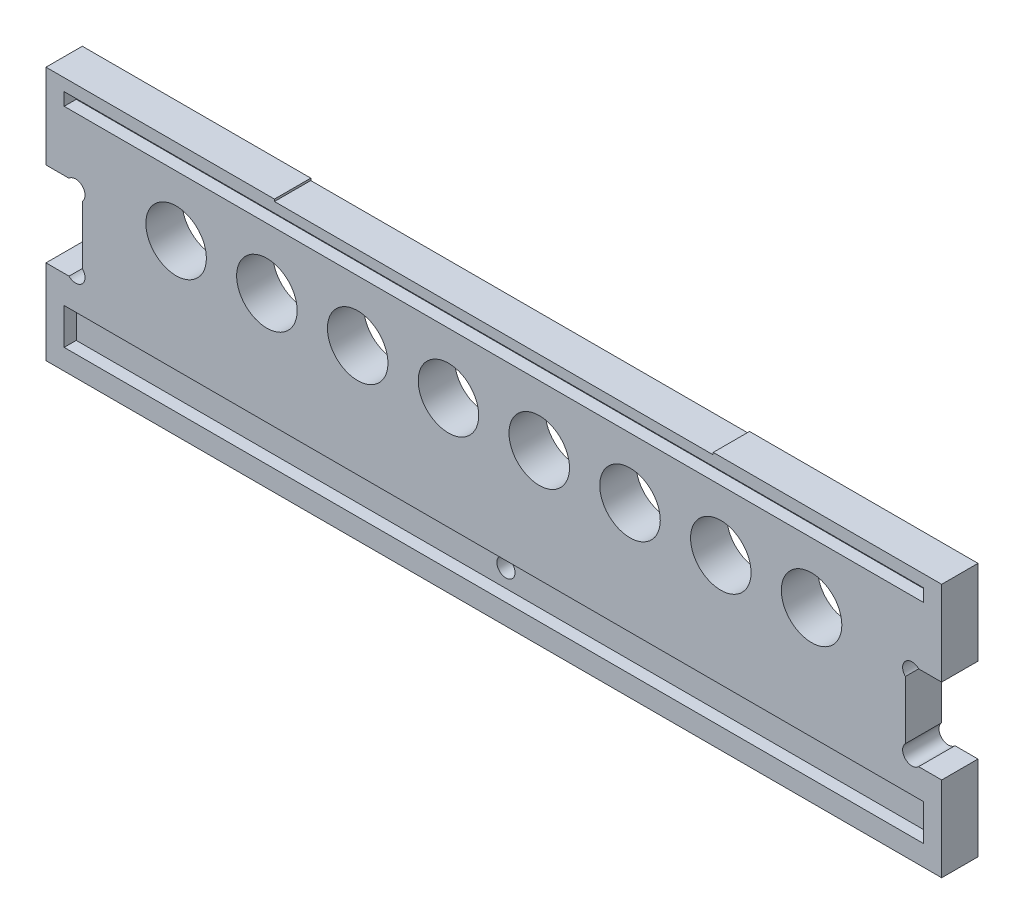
ISO-10303-21;
HEADER;
FILE_DESCRIPTION(('STEP AP214'),'2;1');
FILE_NAME('part.step','',(''),(''),'','','');
FILE_SCHEMA(('AUTOMOTIVE_DESIGN { 1 0 10303 214 1 1 1 1 }'));
ENDSEC;
DATA;
#1=APPLICATION_CONTEXT('core data for automotive mechanical design processes');
#2=APPLICATION_PROTOCOL_DEFINITION('international standard','automotive_design',2000,#1);
#3=PRODUCT_CONTEXT('',#1,'mechanical');
#4=PRODUCT('Part','Part','',(#3));
#5=PRODUCT_RELATED_PRODUCT_CATEGORY('part','',(#4));
#6=PRODUCT_DEFINITION_FORMATION('','',#4);
#7=PRODUCT_DEFINITION_CONTEXT('part definition',#1,'design');
#8=PRODUCT_DEFINITION('design','',#6,#7);
#9=PRODUCT_DEFINITION_SHAPE('','',#8);
#10=(LENGTH_UNIT() NAMED_UNIT(*) SI_UNIT(.MILLI.,.METRE.));
#11=(NAMED_UNIT(*) PLANE_ANGLE_UNIT() SI_UNIT($,.RADIAN.));
#12=(NAMED_UNIT(*) SI_UNIT($,.STERADIAN.) SOLID_ANGLE_UNIT());
#13=UNCERTAINTY_MEASURE_WITH_UNIT(LENGTH_MEASURE(1.E-05),#10,'distance_accuracy_value','');
#14=(GEOMETRIC_REPRESENTATION_CONTEXT(3) GLOBAL_UNCERTAINTY_ASSIGNED_CONTEXT((#13)) GLOBAL_UNIT_ASSIGNED_CONTEXT((#10,
#11,#12)) REPRESENTATION_CONTEXT('',''));
#15=CARTESIAN_POINT('',(0.,0.,0.));
#16=DIRECTION('',(0.,0.,1.));
#17=DIRECTION('',(1.,0.,0.));
#18=AXIS2_PLACEMENT_3D('',#15,#16,#17);
#19=CARTESIAN_POINT('',(74.,6.39762671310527,6.));
#20=DIRECTION('',(0.,0.,-1.));
#21=DIRECTION('',(-1.,0.,0.));
#22=AXIS2_PLACEMENT_3D('',#19,#20,#21);
#23=CYLINDRICAL_SURFACE('',#22,1.5);
#24=CARTESIAN_POINT('',(74.,6.39762671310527,0.));
#25=DIRECTION('',(0.,0.,1.));
#26=DIRECTION('',(1.,0.,0.));
#27=AXIS2_PLACEMENT_3D('',#24,#25,#26);
#28=CIRCLE('',#27,1.5);
#29=CARTESIAN_POINT('',(75.5,6.39762671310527,0.));
#30=VERTEX_POINT('',#29);
#31=EDGE_CURVE('E334',#30,#30,#28,.T.);
#32=ORIENTED_EDGE('',*,*,#31,.F.);
#33=EDGE_LOOP('',(#32));
#34=FACE_BOUND('',#33,.T.);
#35=CARTESIAN_POINT('',(74.,6.39762671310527,4.));
#36=DIRECTION('',(0.,0.,1.));
#37=DIRECTION('',(1.,0.,0.));
#38=AXIS2_PLACEMENT_3D('',#35,#36,#37);
#39=CIRCLE('',#38,1.5);
#40=CARTESIAN_POINT('',(75.5,6.39762671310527,4.));
#41=VERTEX_POINT('',#40);
#42=EDGE_CURVE('E34',#41,#41,#39,.T.);
#43=ORIENTED_EDGE('',*,*,#42,.T.);
#44=EDGE_LOOP('',(#43));
#45=FACE_BOUND('',#44,.T.);
#46=ADVANCED_FACE('F30',(#34,#45),#23,.F.);
#47=CARTESIAN_POINT('',(4.90398448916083,26.9039844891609,6.));
#48=DIRECTION('',(0.,0.,1.));
#49=DIRECTION('',(1.,0.,0.));
#50=AXIS2_PLACEMENT_3D('',#47,#48,#49);
#51=PLANE('',#50);
#52=DIRECTION('',(0.,-1.,0.));
#53=VECTOR('',#52,1.);
#54=CARTESIAN_POINT('',(3.,9.40000000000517,6.));
#55=LINE('',#54,#53);
#56=CARTESIAN_POINT('',(3.,9.40000000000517,6.));
#57=VERTEX_POINT('',#56);
#58=CARTESIAN_POINT('',(3.,3.40000000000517,6.));
#59=VERTEX_POINT('',#58);
#60=EDGE_CURVE('E46',#57,#59,#55,.T.);
#61=ORIENTED_EDGE('',*,*,#60,.F.);
#62=DIRECTION('',(-1.,0.,0.));
#63=VECTOR('',#62,1.);
#64=CARTESIAN_POINT('',(3.,9.40000000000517,6.));
#65=LINE('',#64,#63);
#66=CARTESIAN_POINT('',(145.,9.40000000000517,6.));
#67=VERTEX_POINT('',#66);
#68=EDGE_CURVE('E238',#67,#57,#65,.T.);
#69=ORIENTED_EDGE('',*,*,#68,.F.);
#70=DIRECTION('',(0.,1.,0.));
#71=VECTOR('',#70,1.);
#72=CARTESIAN_POINT('',(145.,9.40000000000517,6.));
#73=LINE('',#72,#71);
#74=CARTESIAN_POINT('',(145.,3.40000000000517,6.));
#75=VERTEX_POINT('',#74);
#76=EDGE_CURVE('E220',#75,#67,#73,.T.);
#77=ORIENTED_EDGE('',*,*,#76,.F.);
#78=DIRECTION('',(1.,0.,0.));
#79=VECTOR('',#78,1.);
#80=CARTESIAN_POINT('',(3.,3.40000000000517,6.));
#81=LINE('',#80,#79);
#82=EDGE_CURVE('E231',#59,#75,#81,.T.);
#83=ORIENTED_EDGE('',*,*,#82,.F.);
#84=EDGE_LOOP('',(#61,#69,#77,#83));
#85=FACE_BOUND('',#84,.T.);
#86=DIRECTION('',(0.,-1.,0.));
#87=VECTOR('',#86,1.);
#88=CARTESIAN_POINT('',(3.,40.,6.));
#89=LINE('',#88,#87);
#90=CARTESIAN_POINT('',(3.,40.,6.));
#91=VERTEX_POINT('',#90);
#92=CARTESIAN_POINT('',(3.,37.89999053,6.));
#93=VERTEX_POINT('',#92);
#94=EDGE_CURVE('E54',#91,#93,#89,.T.);
#95=ORIENTED_EDGE('',*,*,#94,.F.);
#96=DIRECTION('',(-1.,0.,0.));
#97=VECTOR('',#96,1.);
#98=CARTESIAN_POINT('',(3.,40.,6.));
#99=LINE('',#98,#97);
#100=CARTESIAN_POINT('',(145.,40.,6.));
#101=VERTEX_POINT('',#100);
#102=EDGE_CURVE('E263',#101,#91,#99,.T.);
#103=ORIENTED_EDGE('',*,*,#102,.F.);
#104=DIRECTION('',(0.,1.,0.));
#105=VECTOR('',#104,1.);
#106=CARTESIAN_POINT('',(145.,40.,6.));
#107=LINE('',#106,#105);
#108=CARTESIAN_POINT('',(145.,37.89999053,6.));
#109=VERTEX_POINT('',#108);
#110=EDGE_CURVE('E260',#109,#101,#107,.T.);
#111=ORIENTED_EDGE('',*,*,#110,.F.);
#112=DIRECTION('',(1.,0.,0.));
#113=VECTOR('',#112,1.);
#114=CARTESIAN_POINT('',(3.,37.89999053,6.));
#115=LINE('',#114,#113);
#116=EDGE_CURVE('E257',#93,#109,#115,.T.);
#117=ORIENTED_EDGE('',*,*,#116,.F.);
#118=EDGE_LOOP('',(#95,#103,#111,#117));
#119=FACE_BOUND('',#118,.T.);
#120=CARTESIAN_POINT('',(111.5,27.899305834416,6.));
#121=DIRECTION('',(0.,0.,1.));
#122=DIRECTION('',(1.,0.,0.));
#123=AXIS2_PLACEMENT_3D('',#120,#121,#122);
#124=CIRCLE('',#123,5.);
#125=CARTESIAN_POINT('',(116.5,27.899305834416,6.));
#126=VERTEX_POINT('',#125);
#127=EDGE_CURVE('E295',#126,#126,#124,.T.);
#128=ORIENTED_EDGE('',*,*,#127,.F.);
#129=EDGE_LOOP('',(#128));
#130=FACE_BOUND('',#129,.T.);
#131=CARTESIAN_POINT('',(81.5,27.899305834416,6.));
#132=DIRECTION('',(0.,0.,1.));
#133=DIRECTION('',(1.,0.,0.));
#134=AXIS2_PLACEMENT_3D('',#131,#132,#133);
#135=CIRCLE('',#134,5.);
#136=CARTESIAN_POINT('',(86.5,27.899305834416,6.));
#137=VERTEX_POINT('',#136);
#138=EDGE_CURVE('E307',#137,#137,#135,.T.);
#139=ORIENTED_EDGE('',*,*,#138,.F.);
#140=EDGE_LOOP('',(#139));
#141=FACE_BOUND('',#140,.T.);
#142=CARTESIAN_POINT('',(51.5,27.899305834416,6.));
#143=DIRECTION('',(0.,0.,1.));
#144=DIRECTION('',(1.,0.,0.));
#145=AXIS2_PLACEMENT_3D('',#142,#143,#144);
#146=CIRCLE('',#145,5.);
#147=CARTESIAN_POINT('',(56.5,27.899305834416,6.));
#148=VERTEX_POINT('',#147);
#149=EDGE_CURVE('E319',#148,#148,#146,.T.);
#150=ORIENTED_EDGE('',*,*,#149,.F.);
#151=EDGE_LOOP('',(#150));
#152=FACE_BOUND('',#151,.T.);
#153=CARTESIAN_POINT('',(21.5,27.899305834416,6.));
#154=DIRECTION('',(0.,0.,1.));
#155=DIRECTION('',(1.,0.,0.));
#156=AXIS2_PLACEMENT_3D('',#153,#154,#155);
#157=CIRCLE('',#156,5.);
#158=CARTESIAN_POINT('',(26.5,27.899305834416,6.));
#159=VERTEX_POINT('',#158);
#160=EDGE_CURVE('E331',#159,#159,#157,.T.);
#161=ORIENTED_EDGE('',*,*,#160,.F.);
#162=EDGE_LOOP('',(#161));
#163=FACE_BOUND('',#162,.T.);
#164=DIRECTION('',(0.,-1.,0.));
#165=VECTOR('',#164,1.);
#166=CARTESIAN_POINT('',(0.,42.,6.));
#167=LINE('',#166,#165);
#168=CARTESIAN_POINT('',(0.,42.,6.));
#169=VERTEX_POINT('',#168);
#170=CARTESIAN_POINT('',(0.,28.,6.));
#171=VERTEX_POINT('',#170);
#172=EDGE_CURVE('E378',#169,#171,#167,.T.);
#173=ORIENTED_EDGE('',*,*,#172,.T.);
#174=DIRECTION('',(1.,0.,0.));
#175=VECTOR('',#174,1.);
#176=CARTESIAN_POINT('',(0.,28.,6.));
#177=LINE('',#176,#175);
#178=CARTESIAN_POINT('',(3.80796897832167,28.,6.));
#179=VERTEX_POINT('',#178);
#180=EDGE_CURVE('E381',#171,#179,#177,.T.);
#181=ORIENTED_EDGE('',*,*,#180,.T.);
#182=CARTESIAN_POINT('',(4.90398448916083,26.9039844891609,6.));
#183=DIRECTION('',(0.,0.,-1.));
#184=DIRECTION('',(1.,0.,0.));
#185=AXIS2_PLACEMENT_3D('',#182,#183,#184);
#186=CIRCLE('',#185,1.55);
#187=CARTESIAN_POINT('',(6.,25.8079689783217,6.));
#188=VERTEX_POINT('',#187);
#189=EDGE_CURVE('E383',#179,#188,#186,.T.);
#190=ORIENTED_EDGE('',*,*,#189,.T.);
#191=DIRECTION('',(0.,-1.,0.));
#192=VECTOR('',#191,1.);
#193=CARTESIAN_POINT('',(6.,25.8079689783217,6.));
#194=LINE('',#193,#192);
#195=CARTESIAN_POINT('',(6.,16.1920310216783,6.));
#196=VERTEX_POINT('',#195);
#197=EDGE_CURVE('E385',#188,#196,#194,.T.);
#198=ORIENTED_EDGE('',*,*,#197,.T.);
#199=CARTESIAN_POINT('',(4.90398448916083,15.0960155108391,6.));
#200=DIRECTION('',(0.,0.,-1.));
#201=DIRECTION('',(-1.,0.,0.));
#202=AXIS2_PLACEMENT_3D('',#199,#200,#201);
#203=CIRCLE('',#202,1.55);
#204=CARTESIAN_POINT('',(3.80796897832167,14.,6.));
#205=VERTEX_POINT('',#204);
#206=EDGE_CURVE('E387',#196,#205,#203,.T.);
#207=ORIENTED_EDGE('',*,*,#206,.T.);
#208=DIRECTION('',(-1.,0.,0.));
#209=VECTOR('',#208,1.);
#210=CARTESIAN_POINT('',(0.,14.,6.));
#211=LINE('',#210,#209);
#212=CARTESIAN_POINT('',(0.,14.,6.));
#213=VERTEX_POINT('',#212);
#214=EDGE_CURVE('E389',#205,#213,#211,.T.);
#215=ORIENTED_EDGE('',*,*,#214,.T.);
#216=DIRECTION('',(0.,-1.,0.));
#217=VECTOR('',#216,1.);
#218=CARTESIAN_POINT('',(0.,14.,6.));
#219=LINE('',#218,#217);
#220=CARTESIAN_POINT('',(0.,0.,6.));
#221=VERTEX_POINT('',#220);
#222=EDGE_CURVE('E391',#213,#221,#219,.T.);
#223=ORIENTED_EDGE('',*,*,#222,.T.);
#224=DIRECTION('',(1.,0.,0.));
#225=VECTOR('',#224,1.);
#226=CARTESIAN_POINT('',(0.,0.,6.));
#227=LINE('',#226,#225);
#228=CARTESIAN_POINT('',(148.,3.44359306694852E-13,6.));
#229=VERTEX_POINT('',#228);
#230=EDGE_CURVE('E393',#221,#229,#227,.T.);
#231=ORIENTED_EDGE('',*,*,#230,.T.);
#232=DIRECTION('',(0.,1.,0.));
#233=VECTOR('',#232,1.);
#234=CARTESIAN_POINT('',(148.,14.,6.));
#235=LINE('',#234,#233);
#236=CARTESIAN_POINT('',(148.,14.,6.));
#237=VERTEX_POINT('',#236);
#238=EDGE_CURVE('E395',#229,#237,#235,.T.);
#239=ORIENTED_EDGE('',*,*,#238,.T.);
#240=DIRECTION('',(-1.,0.,0.));
#241=VECTOR('',#240,1.);
#242=CARTESIAN_POINT('',(148.,14.,6.));
#243=LINE('',#242,#241);
#244=CARTESIAN_POINT('',(144.192031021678,14.,6.));
#245=VERTEX_POINT('',#244);
#246=EDGE_CURVE('E397',#237,#245,#243,.T.);
#247=ORIENTED_EDGE('',*,*,#246,.T.);
#248=CARTESIAN_POINT('',(143.096015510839,15.0960155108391,6.));
#249=DIRECTION('',(0.,0.,-1.));
#250=DIRECTION('',(1.,0.,0.));
#251=AXIS2_PLACEMENT_3D('',#248,#249,#250);
#252=CIRCLE('',#251,1.55);
#253=CARTESIAN_POINT('',(142.,16.1920310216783,6.));
#254=VERTEX_POINT('',#253);
#255=EDGE_CURVE('E399',#245,#254,#252,.T.);
#256=ORIENTED_EDGE('',*,*,#255,.T.);
#257=DIRECTION('',(0.,1.,0.));
#258=VECTOR('',#257,1.);
#259=CARTESIAN_POINT('',(142.,25.8079689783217,6.));
#260=LINE('',#259,#258);
#261=CARTESIAN_POINT('',(142.,25.8079689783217,6.));
#262=VERTEX_POINT('',#261);
#263=EDGE_CURVE('E401',#254,#262,#260,.T.);
#264=ORIENTED_EDGE('',*,*,#263,.T.);
#265=CARTESIAN_POINT('',(143.096015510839,26.9039844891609,6.));
#266=DIRECTION('',(0.,0.,-1.));
#267=DIRECTION('',(-1.,0.,0.));
#268=AXIS2_PLACEMENT_3D('',#265,#266,#267);
#269=CIRCLE('',#268,1.55);
#270=CARTESIAN_POINT('',(144.192031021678,28.,6.));
#271=VERTEX_POINT('',#270);
#272=EDGE_CURVE('E403',#262,#271,#269,.T.);
#273=ORIENTED_EDGE('',*,*,#272,.T.);
#274=DIRECTION('',(1.,0.,0.));
#275=VECTOR('',#274,1.);
#276=CARTESIAN_POINT('',(148.,28.,6.));
#277=LINE('',#276,#275);
#278=CARTESIAN_POINT('',(148.,28.,6.));
#279=VERTEX_POINT('',#278);
#280=EDGE_CURVE('E405',#271,#279,#277,.T.);
#281=ORIENTED_EDGE('',*,*,#280,.T.);
#282=DIRECTION('',(0.,1.,0.));
#283=VECTOR('',#282,1.);
#284=CARTESIAN_POINT('',(148.,42.0000000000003,6.));
#285=LINE('',#284,#283);
#286=CARTESIAN_POINT('',(148.,42.0000000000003,6.));
#287=VERTEX_POINT('',#286);
#288=EDGE_CURVE('E407',#279,#287,#285,.T.);
#289=ORIENTED_EDGE('',*,*,#288,.T.);
#290=DIRECTION('',(-1.,0.,0.));
#291=VECTOR('',#290,1.);
#292=CARTESIAN_POINT('',(110.25,42.0000000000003,6.));
#293=LINE('',#292,#291);
#294=CARTESIAN_POINT('',(110.25,42.0000000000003,6.));
#295=VERTEX_POINT('',#294);
#296=EDGE_CURVE('E409',#287,#295,#293,.T.);
#297=ORIENTED_EDGE('',*,*,#296,.T.);
#298=DIRECTION('',(0.,-1.,0.));
#299=VECTOR('',#298,1.);
#300=CARTESIAN_POINT('',(110.25,42.0000000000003,6.));
#301=LINE('',#300,#299);
#302=CARTESIAN_POINT('',(110.25,41.65,6.));
#303=VERTEX_POINT('',#302);
#304=EDGE_CURVE('E411',#295,#303,#301,.T.);
#305=ORIENTED_EDGE('',*,*,#304,.T.);
#306=DIRECTION('',(-1.,0.,0.));
#307=VECTOR('',#306,1.);
#308=CARTESIAN_POINT('',(37.75,41.65,6.));
#309=LINE('',#308,#307);
#310=CARTESIAN_POINT('',(37.75,41.65,6.));
#311=VERTEX_POINT('',#310);
#312=EDGE_CURVE('E413',#303,#311,#309,.T.);
#313=ORIENTED_EDGE('',*,*,#312,.T.);
#314=DIRECTION('',(0.,1.,0.));
#315=VECTOR('',#314,1.);
#316=CARTESIAN_POINT('',(37.75,41.65,6.));
#317=LINE('',#316,#315);
#318=CARTESIAN_POINT('',(37.75,42.0000000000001,6.));
#319=VERTEX_POINT('',#318);
#320=EDGE_CURVE('E415',#311,#319,#317,.T.);
#321=ORIENTED_EDGE('',*,*,#320,.T.);
#322=DIRECTION('',(-1.,0.,0.));
#323=VECTOR('',#322,1.);
#324=CARTESIAN_POINT('',(0.,42.,6.));
#325=LINE('',#324,#323);
#326=EDGE_CURVE('E417',#319,#169,#325,.T.);
#327=ORIENTED_EDGE('',*,*,#326,.T.);
#328=EDGE_LOOP('',(#173,#181,#190,#198,#207,#215,#223,#231,#239,#247,#256,#264,#273,#281,#289,
#297,#305,#313,#321,#327));
#329=FACE_BOUND('',#328,.T.);
#330=CARTESIAN_POINT('',(36.5,27.899305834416,6.));
#331=DIRECTION('',(0.,0.,1.));
#332=DIRECTION('',(1.,0.,0.));
#333=AXIS2_PLACEMENT_3D('',#330,#331,#332);
#334=CIRCLE('',#333,5.);
#335=CARTESIAN_POINT('',(41.5,27.899305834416,6.));
#336=VERTEX_POINT('',#335);
#337=EDGE_CURVE('E325',#336,#336,#334,.T.);
#338=ORIENTED_EDGE('',*,*,#337,.F.);
#339=EDGE_LOOP('',(#338));
#340=FACE_BOUND('',#339,.T.);
#341=CARTESIAN_POINT('',(66.5,27.899305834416,6.));
#342=DIRECTION('',(0.,0.,1.));
#343=DIRECTION('',(1.,0.,0.));
#344=AXIS2_PLACEMENT_3D('',#341,#342,#343);
#345=CIRCLE('',#344,5.);
#346=CARTESIAN_POINT('',(71.5,27.899305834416,6.));
#347=VERTEX_POINT('',#346);
#348=EDGE_CURVE('E313',#347,#347,#345,.T.);
#349=ORIENTED_EDGE('',*,*,#348,.F.);
#350=EDGE_LOOP('',(#349));
#351=FACE_BOUND('',#350,.T.);
#352=CARTESIAN_POINT('',(96.5,27.899305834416,6.));
#353=DIRECTION('',(0.,0.,1.));
#354=DIRECTION('',(1.,0.,0.));
#355=AXIS2_PLACEMENT_3D('',#352,#353,#354);
#356=CIRCLE('',#355,5.);
#357=CARTESIAN_POINT('',(101.5,27.899305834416,6.));
#358=VERTEX_POINT('',#357);
#359=EDGE_CURVE('E301',#358,#358,#356,.T.);
#360=ORIENTED_EDGE('',*,*,#359,.F.);
#361=EDGE_LOOP('',(#360));
#362=FACE_BOUND('',#361,.T.);
#363=CARTESIAN_POINT('',(126.5,27.899305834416,6.));
#364=DIRECTION('',(0.,0.,1.));
#365=DIRECTION('',(1.,0.,0.));
#366=AXIS2_PLACEMENT_3D('',#363,#364,#365);
#367=CIRCLE('',#366,4.99999999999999);
#368=CARTESIAN_POINT('',(131.5,27.899305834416,6.));
#369=VERTEX_POINT('',#368);
#370=EDGE_CURVE('E289',#369,#369,#367,.T.);
#371=ORIENTED_EDGE('',*,*,#370,.F.);
#372=EDGE_LOOP('',(#371));
#373=FACE_BOUND('',#372,.T.);
#374=ADVANCED_FACE('F235',(#85,#119,#130,#141,#152,#163,#329,#340,#351,#362,#373),#51,.T.);
#375=CARTESIAN_POINT('',(4.90398448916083,26.9039844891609,0.));
#376=DIRECTION('',(0.,0.,1.));
#377=DIRECTION('',(1.,0.,0.));
#378=AXIS2_PLACEMENT_3D('',#375,#376,#377);
#379=PLANE('',#378);
#380=CARTESIAN_POINT('',(111.5,27.899305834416,0.));
#381=DIRECTION('',(0.,0.,1.));
#382=DIRECTION('',(1.,0.,0.));
#383=AXIS2_PLACEMENT_3D('',#380,#381,#382);
#384=CIRCLE('',#383,5.);
#385=CARTESIAN_POINT('',(116.5,27.899305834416,0.));
#386=VERTEX_POINT('',#385);
#387=EDGE_CURVE('E292',#386,#386,#384,.T.);
#388=ORIENTED_EDGE('',*,*,#387,.T.);
#389=EDGE_LOOP('',(#388));
#390=FACE_BOUND('',#389,.T.);
#391=CARTESIAN_POINT('',(81.5,27.899305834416,0.));
#392=DIRECTION('',(0.,0.,1.));
#393=DIRECTION('',(1.,0.,0.));
#394=AXIS2_PLACEMENT_3D('',#391,#392,#393);
#395=CIRCLE('',#394,5.);
#396=CARTESIAN_POINT('',(86.5,27.899305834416,0.));
#397=VERTEX_POINT('',#396);
#398=EDGE_CURVE('E304',#397,#397,#395,.T.);
#399=ORIENTED_EDGE('',*,*,#398,.T.);
#400=EDGE_LOOP('',(#399));
#401=FACE_BOUND('',#400,.T.);
#402=CARTESIAN_POINT('',(51.5,27.899305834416,0.));
#403=DIRECTION('',(0.,0.,1.));
#404=DIRECTION('',(1.,0.,0.));
#405=AXIS2_PLACEMENT_3D('',#402,#403,#404);
#406=CIRCLE('',#405,5.);
#407=CARTESIAN_POINT('',(56.5,27.899305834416,0.));
#408=VERTEX_POINT('',#407);
#409=EDGE_CURVE('E316',#408,#408,#406,.T.);
#410=ORIENTED_EDGE('',*,*,#409,.T.);
#411=EDGE_LOOP('',(#410));
#412=FACE_BOUND('',#411,.T.);
#413=CARTESIAN_POINT('',(21.5,27.899305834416,0.));
#414=DIRECTION('',(0.,0.,1.));
#415=DIRECTION('',(1.,0.,0.));
#416=AXIS2_PLACEMENT_3D('',#413,#414,#415);
#417=CIRCLE('',#416,5.);
#418=CARTESIAN_POINT('',(26.5,27.899305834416,0.));
#419=VERTEX_POINT('',#418);
#420=EDGE_CURVE('E328',#419,#419,#417,.T.);
#421=ORIENTED_EDGE('',*,*,#420,.T.);
#422=EDGE_LOOP('',(#421));
#423=FACE_BOUND('',#422,.T.);
#424=DIRECTION('',(0.,-1.,0.));
#425=VECTOR('',#424,1.);
#426=CARTESIAN_POINT('',(0.,42.,0.));
#427=LINE('',#426,#425);
#428=CARTESIAN_POINT('',(0.,42.,0.));
#429=VERTEX_POINT('',#428);
#430=CARTESIAN_POINT('',(0.,28.,0.));
#431=VERTEX_POINT('',#430);
#432=EDGE_CURVE('E337',#429,#431,#427,.T.);
#433=ORIENTED_EDGE('',*,*,#432,.F.);
#434=DIRECTION('',(-1.,0.,0.));
#435=VECTOR('',#434,1.);
#436=CARTESIAN_POINT('',(0.,42.,0.));
#437=LINE('',#436,#435);
#438=CARTESIAN_POINT('',(37.75,42.0000000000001,0.));
#439=VERTEX_POINT('',#438);
#440=EDGE_CURVE('E376',#439,#429,#437,.T.);
#441=ORIENTED_EDGE('',*,*,#440,.F.);
#442=DIRECTION('',(0.,1.,0.));
#443=VECTOR('',#442,1.);
#444=CARTESIAN_POINT('',(37.75,41.65,0.));
#445=LINE('',#444,#443);
#446=CARTESIAN_POINT('',(37.75,41.65,0.));
#447=VERTEX_POINT('',#446);
#448=EDGE_CURVE('E374',#447,#439,#445,.T.);
#449=ORIENTED_EDGE('',*,*,#448,.F.);
#450=DIRECTION('',(-1.,0.,0.));
#451=VECTOR('',#450,1.);
#452=CARTESIAN_POINT('',(37.75,41.65,0.));
#453=LINE('',#452,#451);
#454=CARTESIAN_POINT('',(110.25,41.65,0.));
#455=VERTEX_POINT('',#454);
#456=EDGE_CURVE('E372',#455,#447,#453,.T.);
#457=ORIENTED_EDGE('',*,*,#456,.F.);
#458=DIRECTION('',(0.,-1.,0.));
#459=VECTOR('',#458,1.);
#460=CARTESIAN_POINT('',(110.25,42.0000000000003,0.));
#461=LINE('',#460,#459);
#462=CARTESIAN_POINT('',(110.25,42.0000000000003,0.));
#463=VERTEX_POINT('',#462);
#464=EDGE_CURVE('E370',#463,#455,#461,.T.);
#465=ORIENTED_EDGE('',*,*,#464,.F.);
#466=DIRECTION('',(-1.,0.,0.));
#467=VECTOR('',#466,1.);
#468=CARTESIAN_POINT('',(110.25,42.0000000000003,0.));
#469=LINE('',#468,#467);
#470=CARTESIAN_POINT('',(148.,42.0000000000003,0.));
#471=VERTEX_POINT('',#470);
#472=EDGE_CURVE('E368',#471,#463,#469,.T.);
#473=ORIENTED_EDGE('',*,*,#472,.F.);
#474=DIRECTION('',(0.,1.,0.));
#475=VECTOR('',#474,1.);
#476=CARTESIAN_POINT('',(148.,42.0000000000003,0.));
#477=LINE('',#476,#475);
#478=CARTESIAN_POINT('',(148.,28.,0.));
#479=VERTEX_POINT('',#478);
#480=EDGE_CURVE('E366',#479,#471,#477,.T.);
#481=ORIENTED_EDGE('',*,*,#480,.F.);
#482=DIRECTION('',(1.,0.,0.));
#483=VECTOR('',#482,1.);
#484=CARTESIAN_POINT('',(148.,28.,0.));
#485=LINE('',#484,#483);
#486=CARTESIAN_POINT('',(144.192031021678,28.,0.));
#487=VERTEX_POINT('',#486);
#488=EDGE_CURVE('E364',#487,#479,#485,.T.);
#489=ORIENTED_EDGE('',*,*,#488,.F.);
#490=CARTESIAN_POINT('',(143.096015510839,26.9039844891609,0.));
#491=DIRECTION('',(0.,0.,-1.));
#492=DIRECTION('',(-1.,0.,0.));
#493=AXIS2_PLACEMENT_3D('',#490,#491,#492);
#494=CIRCLE('',#493,1.55);
#495=CARTESIAN_POINT('',(142.,25.8079689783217,0.));
#496=VERTEX_POINT('',#495);
#497=EDGE_CURVE('E362',#496,#487,#494,.T.);
#498=ORIENTED_EDGE('',*,*,#497,.F.);
#499=DIRECTION('',(0.,1.,0.));
#500=VECTOR('',#499,1.);
#501=CARTESIAN_POINT('',(142.,25.8079689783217,0.));
#502=LINE('',#501,#500);
#503=CARTESIAN_POINT('',(142.,16.1920310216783,0.));
#504=VERTEX_POINT('',#503);
#505=EDGE_CURVE('E360',#504,#496,#502,.T.);
#506=ORIENTED_EDGE('',*,*,#505,.F.);
#507=CARTESIAN_POINT('',(143.096015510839,15.0960155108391,0.));
#508=DIRECTION('',(0.,0.,-1.));
#509=DIRECTION('',(1.,0.,0.));
#510=AXIS2_PLACEMENT_3D('',#507,#508,#509);
#511=CIRCLE('',#510,1.55);
#512=CARTESIAN_POINT('',(144.192031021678,14.,0.));
#513=VERTEX_POINT('',#512);
#514=EDGE_CURVE('E358',#513,#504,#511,.T.);
#515=ORIENTED_EDGE('',*,*,#514,.F.);
#516=DIRECTION('',(-1.,0.,0.));
#517=VECTOR('',#516,1.);
#518=CARTESIAN_POINT('',(148.,14.,0.));
#519=LINE('',#518,#517);
#520=CARTESIAN_POINT('',(148.,14.,0.));
#521=VERTEX_POINT('',#520);
#522=EDGE_CURVE('E356',#521,#513,#519,.T.);
#523=ORIENTED_EDGE('',*,*,#522,.F.);
#524=DIRECTION('',(0.,1.,0.));
#525=VECTOR('',#524,1.);
#526=CARTESIAN_POINT('',(148.,14.,0.));
#527=LINE('',#526,#525);
#528=CARTESIAN_POINT('',(148.,3.44359306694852E-13,0.));
#529=VERTEX_POINT('',#528);
#530=EDGE_CURVE('E354',#529,#521,#527,.T.);
#531=ORIENTED_EDGE('',*,*,#530,.F.);
#532=DIRECTION('',(1.,0.,0.));
#533=VECTOR('',#532,1.);
#534=CARTESIAN_POINT('',(0.,0.,0.));
#535=LINE('',#534,#533);
#536=CARTESIAN_POINT('',(0.,0.,0.));
#537=VERTEX_POINT('',#536);
#538=EDGE_CURVE('E352',#537,#529,#535,.T.);
#539=ORIENTED_EDGE('',*,*,#538,.F.);
#540=DIRECTION('',(0.,-1.,0.));
#541=VECTOR('',#540,1.);
#542=CARTESIAN_POINT('',(0.,14.,0.));
#543=LINE('',#542,#541);
#544=CARTESIAN_POINT('',(0.,14.,0.));
#545=VERTEX_POINT('',#544);
#546=EDGE_CURVE('E350',#545,#537,#543,.T.);
#547=ORIENTED_EDGE('',*,*,#546,.F.);
#548=DIRECTION('',(-1.,0.,0.));
#549=VECTOR('',#548,1.);
#550=CARTESIAN_POINT('',(0.,14.,0.));
#551=LINE('',#550,#549);
#552=CARTESIAN_POINT('',(3.80796897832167,14.,0.));
#553=VERTEX_POINT('',#552);
#554=EDGE_CURVE('E348',#553,#545,#551,.T.);
#555=ORIENTED_EDGE('',*,*,#554,.F.);
#556=CARTESIAN_POINT('',(4.90398448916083,15.0960155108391,0.));
#557=DIRECTION('',(0.,0.,-1.));
#558=DIRECTION('',(-1.,0.,0.));
#559=AXIS2_PLACEMENT_3D('',#556,#557,#558);
#560=CIRCLE('',#559,1.55);
#561=CARTESIAN_POINT('',(6.,16.1920310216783,0.));
#562=VERTEX_POINT('',#561);
#563=EDGE_CURVE('E346',#562,#553,#560,.T.);
#564=ORIENTED_EDGE('',*,*,#563,.F.);
#565=DIRECTION('',(0.,-1.,0.));
#566=VECTOR('',#565,1.);
#567=CARTESIAN_POINT('',(6.,25.8079689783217,0.));
#568=LINE('',#567,#566);
#569=CARTESIAN_POINT('',(6.,25.8079689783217,0.));
#570=VERTEX_POINT('',#569);
#571=EDGE_CURVE('E344',#570,#562,#568,.T.);
#572=ORIENTED_EDGE('',*,*,#571,.F.);
#573=CARTESIAN_POINT('',(4.90398448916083,26.9039844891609,0.));
#574=DIRECTION('',(0.,0.,-1.));
#575=DIRECTION('',(1.,0.,0.));
#576=AXIS2_PLACEMENT_3D('',#573,#574,#575);
#577=CIRCLE('',#576,1.55);
#578=CARTESIAN_POINT('',(3.80796897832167,28.,0.));
#579=VERTEX_POINT('',#578);
#580=EDGE_CURVE('E342',#579,#570,#577,.T.);
#581=ORIENTED_EDGE('',*,*,#580,.F.);
#582=DIRECTION('',(1.,0.,0.));
#583=VECTOR('',#582,1.);
#584=CARTESIAN_POINT('',(0.,28.,0.));
#585=LINE('',#584,#583);
#586=EDGE_CURVE('E340',#431,#579,#585,.T.);
#587=ORIENTED_EDGE('',*,*,#586,.F.);
#588=EDGE_LOOP('',(#433,#441,#449,#457,#465,#473,#481,#489,#498,#506,#515,#523,#531,#539,#547,
#555,#564,#572,#581,#587));
#589=FACE_BOUND('',#588,.T.);
#590=ORIENTED_EDGE('',*,*,#31,.T.);
#591=EDGE_LOOP('',(#590));
#592=FACE_BOUND('',#591,.T.);
#593=CARTESIAN_POINT('',(36.5,27.899305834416,0.));
#594=DIRECTION('',(0.,0.,1.));
#595=DIRECTION('',(1.,0.,0.));
#596=AXIS2_PLACEMENT_3D('',#593,#594,#595);
#597=CIRCLE('',#596,5.);
#598=CARTESIAN_POINT('',(41.5,27.899305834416,0.));
#599=VERTEX_POINT('',#598);
#600=EDGE_CURVE('E322',#599,#599,#597,.T.);
#601=ORIENTED_EDGE('',*,*,#600,.T.);
#602=EDGE_LOOP('',(#601));
#603=FACE_BOUND('',#602,.T.);
#604=CARTESIAN_POINT('',(66.5,27.899305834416,0.));
#605=DIRECTION('',(0.,0.,1.));
#606=DIRECTION('',(1.,0.,0.));
#607=AXIS2_PLACEMENT_3D('',#604,#605,#606);
#608=CIRCLE('',#607,5.);
#609=CARTESIAN_POINT('',(71.5,27.899305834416,0.));
#610=VERTEX_POINT('',#609);
#611=EDGE_CURVE('E310',#610,#610,#608,.T.);
#612=ORIENTED_EDGE('',*,*,#611,.T.);
#613=EDGE_LOOP('',(#612));
#614=FACE_BOUND('',#613,.T.);
#615=CARTESIAN_POINT('',(96.5,27.899305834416,0.));
#616=DIRECTION('',(0.,0.,1.));
#617=DIRECTION('',(1.,0.,0.));
#618=AXIS2_PLACEMENT_3D('',#615,#616,#617);
#619=CIRCLE('',#618,5.);
#620=CARTESIAN_POINT('',(101.5,27.899305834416,0.));
#621=VERTEX_POINT('',#620);
#622=EDGE_CURVE('E298',#621,#621,#619,.T.);
#623=ORIENTED_EDGE('',*,*,#622,.T.);
#624=EDGE_LOOP('',(#623));
#625=FACE_BOUND('',#624,.T.);
#626=CARTESIAN_POINT('',(126.5,27.899305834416,0.));
#627=DIRECTION('',(0.,0.,1.));
#628=DIRECTION('',(1.,0.,0.));
#629=AXIS2_PLACEMENT_3D('',#626,#627,#628);
#630=CIRCLE('',#629,4.99999999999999);
#631=CARTESIAN_POINT('',(131.5,27.899305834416,0.));
#632=VERTEX_POINT('',#631);
#633=EDGE_CURVE('E281',#632,#632,#630,.T.);
#634=ORIENTED_EDGE('',*,*,#633,.T.);
#635=EDGE_LOOP('',(#634));
#636=FACE_BOUND('',#635,.T.);
#637=ADVANCED_FACE('F484',(#390,#401,#412,#423,#589,#592,#603,#614,#625,#636),#379,.F.);
#638=CARTESIAN_POINT('',(0.,42.,6.));
#639=DIRECTION('',(1.,0.,0.));
#640=DIRECTION('',(0.,1.,0.));
#641=AXIS2_PLACEMENT_3D('',#638,#639,#640);
#642=PLANE('',#641);
#643=ORIENTED_EDGE('',*,*,#432,.T.);
#644=DIRECTION('',(0.,0.,-1.));
#645=VECTOR('',#644,1.);
#646=CARTESIAN_POINT('',(0.,28.,6.));
#647=LINE('',#646,#645);
#648=EDGE_CURVE('E11',#171,#431,#647,.T.);
#649=ORIENTED_EDGE('',*,*,#648,.F.);
#650=ORIENTED_EDGE('',*,*,#172,.F.);
#651=DIRECTION('',(0.,0.,-1.));
#652=VECTOR('',#651,1.);
#653=CARTESIAN_POINT('',(0.,42.,6.));
#654=LINE('',#653,#652);
#655=EDGE_CURVE('E419',#169,#429,#654,.T.);
#656=ORIENTED_EDGE('',*,*,#655,.T.);
#657=EDGE_LOOP('',(#643,#649,#650,#656));
#658=FACE_BOUND('',#657,.T.);
#659=ADVANCED_FACE('F32',(#658),#642,.F.);
#660=CARTESIAN_POINT('',(0.,28.,6.));
#661=DIRECTION('',(0.,1.,0.));
#662=DIRECTION('',(0.,0.,1.));
#663=AXIS2_PLACEMENT_3D('',#660,#661,#662);
#664=PLANE('',#663);
#665=ORIENTED_EDGE('',*,*,#586,.T.);
#666=DIRECTION('',(0.,0.,-1.));
#667=VECTOR('',#666,1.);
#668=CARTESIAN_POINT('',(3.80796897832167,28.,6.));
#669=LINE('',#668,#667);
#670=EDGE_CURVE('E39',#179,#579,#669,.T.);
#671=ORIENTED_EDGE('',*,*,#670,.F.);
#672=ORIENTED_EDGE('',*,*,#180,.F.);
#673=ORIENTED_EDGE('',*,*,#648,.T.);
#674=EDGE_LOOP('',(#665,#671,#672,#673));
#675=FACE_BOUND('',#674,.T.);
#676=ADVANCED_FACE('F502',(#675),#664,.F.);
#677=CARTESIAN_POINT('',(4.90398448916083,26.9039844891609,6.));
#678=DIRECTION('',(0.,0.,-1.));
#679=DIRECTION('',(-1.,0.,0.));
#680=AXIS2_PLACEMENT_3D('',#677,#678,#679);
#681=CYLINDRICAL_SURFACE('',#680,1.55);
#682=ORIENTED_EDGE('',*,*,#580,.T.);
#683=DIRECTION('',(0.,0.,-1.));
#684=VECTOR('',#683,1.);
#685=CARTESIAN_POINT('',(6.,25.8079689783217,6.));
#686=LINE('',#685,#684);
#687=EDGE_CURVE('E470',#188,#570,#686,.T.);
#688=ORIENTED_EDGE('',*,*,#687,.F.);
#689=ORIENTED_EDGE('',*,*,#189,.F.);
#690=ORIENTED_EDGE('',*,*,#670,.T.);
#691=EDGE_LOOP('',(#682,#688,#689,#690));
#692=FACE_BOUND('',#691,.T.);
#693=ADVANCED_FACE('F478',(#692),#681,.F.);
#694=CARTESIAN_POINT('',(6.,25.8079689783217,6.));
#695=DIRECTION('',(1.,0.,0.));
#696=DIRECTION('',(0.,0.,-1.));
#697=AXIS2_PLACEMENT_3D('',#694,#695,#696);
#698=PLANE('',#697);
#699=ORIENTED_EDGE('',*,*,#571,.T.);
#700=DIRECTION('',(0.,0.,-1.));
#701=VECTOR('',#700,1.);
#702=CARTESIAN_POINT('',(6.,16.1920310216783,6.));
#703=LINE('',#702,#701);
#704=EDGE_CURVE('E467',#196,#562,#703,.T.);
#705=ORIENTED_EDGE('',*,*,#704,.F.);
#706=ORIENTED_EDGE('',*,*,#197,.F.);
#707=ORIENTED_EDGE('',*,*,#687,.T.);
#708=EDGE_LOOP('',(#699,#705,#706,#707));
#709=FACE_BOUND('',#708,.T.);
#710=ADVANCED_FACE('F490',(#709),#698,.F.);
#711=CARTESIAN_POINT('',(4.90398448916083,15.0960155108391,6.));
#712=DIRECTION('',(0.,0.,-1.));
#713=DIRECTION('',(-1.,0.,0.));
#714=AXIS2_PLACEMENT_3D('',#711,#712,#713);
#715=CYLINDRICAL_SURFACE('',#714,1.55);
#716=ORIENTED_EDGE('',*,*,#563,.T.);
#717=DIRECTION('',(0.,0.,-1.));
#718=VECTOR('',#717,1.);
#719=CARTESIAN_POINT('',(3.80796897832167,14.,6.));
#720=LINE('',#719,#718);
#721=EDGE_CURVE('E464',#205,#553,#720,.T.);
#722=ORIENTED_EDGE('',*,*,#721,.F.);
#723=ORIENTED_EDGE('',*,*,#206,.F.);
#724=ORIENTED_EDGE('',*,*,#704,.T.);
#725=EDGE_LOOP('',(#716,#722,#723,#724));
#726=FACE_BOUND('',#725,.T.);
#727=ADVANCED_FACE('F494',(#726),#715,.F.);
#728=CARTESIAN_POINT('',(0.,14.,6.));
#729=DIRECTION('',(0.,-1.,0.));
#730=DIRECTION('',(0.,0.,-1.));
#731=AXIS2_PLACEMENT_3D('',#728,#729,#730);
#732=PLANE('',#731);
#733=ORIENTED_EDGE('',*,*,#554,.T.);
#734=DIRECTION('',(0.,0.,-1.));
#735=VECTOR('',#734,1.);
#736=CARTESIAN_POINT('',(0.,14.,6.));
#737=LINE('',#736,#735);
#738=EDGE_CURVE('E461',#213,#545,#737,.T.);
#739=ORIENTED_EDGE('',*,*,#738,.F.);
#740=ORIENTED_EDGE('',*,*,#214,.F.);
#741=ORIENTED_EDGE('',*,*,#721,.T.);
#742=EDGE_LOOP('',(#733,#739,#740,#741));
#743=FACE_BOUND('',#742,.T.);
#744=ADVANCED_FACE('F575',(#743),#732,.F.);
#745=CARTESIAN_POINT('',(0.,14.,6.));
#746=DIRECTION('',(1.,0.,0.));
#747=DIRECTION('',(0.,1.,0.));
#748=AXIS2_PLACEMENT_3D('',#745,#746,#747);
#749=PLANE('',#748);
#750=ORIENTED_EDGE('',*,*,#546,.T.);
#751=DIRECTION('',(0.,0.,-1.));
#752=VECTOR('',#751,1.);
#753=CARTESIAN_POINT('',(0.,0.,6.));
#754=LINE('',#753,#752);
#755=EDGE_CURVE('E458',#221,#537,#754,.T.);
#756=ORIENTED_EDGE('',*,*,#755,.F.);
#757=ORIENTED_EDGE('',*,*,#222,.F.);
#758=ORIENTED_EDGE('',*,*,#738,.T.);
#759=EDGE_LOOP('',(#750,#756,#757,#758));
#760=FACE_BOUND('',#759,.T.);
#761=ADVANCED_FACE('F573',(#760),#749,.F.);
#762=CARTESIAN_POINT('',(0.,0.,6.));
#763=DIRECTION('',(0.,1.,0.));
#764=DIRECTION('',(-1.,0.,0.));
#765=AXIS2_PLACEMENT_3D('',#762,#763,#764);
#766=PLANE('',#765);
#767=ORIENTED_EDGE('',*,*,#538,.T.);
#768=DIRECTION('',(0.,0.,-1.));
#769=VECTOR('',#768,1.);
#770=CARTESIAN_POINT('',(148.,3.44359306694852E-13,6.));
#771=LINE('',#770,#769);
#772=EDGE_CURVE('E455',#229,#529,#771,.T.);
#773=ORIENTED_EDGE('',*,*,#772,.F.);
#774=ORIENTED_EDGE('',*,*,#230,.F.);
#775=ORIENTED_EDGE('',*,*,#755,.T.);
#776=EDGE_LOOP('',(#767,#773,#774,#775));
#777=FACE_BOUND('',#776,.T.);
#778=ADVANCED_FACE('F568',(#777),#766,.F.);
#779=CARTESIAN_POINT('',(148.,14.,6.));
#780=DIRECTION('',(-1.,0.,0.));
#781=DIRECTION('',(0.,0.,1.));
#782=AXIS2_PLACEMENT_3D('',#779,#780,#781);
#783=PLANE('',#782);
#784=ORIENTED_EDGE('',*,*,#530,.T.);
#785=DIRECTION('',(0.,0.,-1.));
#786=VECTOR('',#785,1.);
#787=CARTESIAN_POINT('',(148.,14.,6.));
#788=LINE('',#787,#786);
#789=EDGE_CURVE('E452',#237,#521,#788,.T.);
#790=ORIENTED_EDGE('',*,*,#789,.F.);
#791=ORIENTED_EDGE('',*,*,#238,.F.);
#792=ORIENTED_EDGE('',*,*,#772,.T.);
#793=EDGE_LOOP('',(#784,#790,#791,#792));
#794=FACE_BOUND('',#793,.T.);
#795=ADVANCED_FACE('F563',(#794),#783,.F.);
#796=CARTESIAN_POINT('',(148.,14.,6.));
#797=DIRECTION('',(0.,-1.,0.));
#798=DIRECTION('',(1.,0.,0.));
#799=AXIS2_PLACEMENT_3D('',#796,#797,#798);
#800=PLANE('',#799);
#801=ORIENTED_EDGE('',*,*,#522,.T.);
#802=DIRECTION('',(0.,0.,-1.));
#803=VECTOR('',#802,1.);
#804=CARTESIAN_POINT('',(144.192031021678,14.,6.));
#805=LINE('',#804,#803);
#806=EDGE_CURVE('E449',#245,#513,#805,.T.);
#807=ORIENTED_EDGE('',*,*,#806,.F.);
#808=ORIENTED_EDGE('',*,*,#246,.F.);
#809=ORIENTED_EDGE('',*,*,#789,.T.);
#810=EDGE_LOOP('',(#801,#807,#808,#809));
#811=FACE_BOUND('',#810,.T.);
#812=ADVANCED_FACE('F559',(#811),#800,.F.);
#813=CARTESIAN_POINT('',(143.096015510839,15.0960155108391,6.));
#814=DIRECTION('',(0.,0.,-1.));
#815=DIRECTION('',(-1.,0.,0.));
#816=AXIS2_PLACEMENT_3D('',#813,#814,#815);
#817=CYLINDRICAL_SURFACE('',#816,1.55);
#818=ORIENTED_EDGE('',*,*,#514,.T.);
#819=DIRECTION('',(0.,0.,-1.));
#820=VECTOR('',#819,1.);
#821=CARTESIAN_POINT('',(142.,16.1920310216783,6.));
#822=LINE('',#821,#820);
#823=EDGE_CURVE('E446',#254,#504,#822,.T.);
#824=ORIENTED_EDGE('',*,*,#823,.F.);
#825=ORIENTED_EDGE('',*,*,#255,.F.);
#826=ORIENTED_EDGE('',*,*,#806,.T.);
#827=EDGE_LOOP('',(#818,#824,#825,#826));
#828=FACE_BOUND('',#827,.T.);
#829=ADVANCED_FACE('F554',(#828),#817,.F.);
#830=CARTESIAN_POINT('',(142.,25.8079689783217,6.));
#831=DIRECTION('',(-1.,0.,0.));
#832=DIRECTION('',(0.,0.,1.));
#833=AXIS2_PLACEMENT_3D('',#830,#831,#832);
#834=PLANE('',#833);
#835=ORIENTED_EDGE('',*,*,#505,.T.);
#836=DIRECTION('',(0.,0.,-1.));
#837=VECTOR('',#836,1.);
#838=CARTESIAN_POINT('',(142.,25.8079689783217,6.));
#839=LINE('',#838,#837);
#840=EDGE_CURVE('E443',#262,#496,#839,.T.);
#841=ORIENTED_EDGE('',*,*,#840,.F.);
#842=ORIENTED_EDGE('',*,*,#263,.F.);
#843=ORIENTED_EDGE('',*,*,#823,.T.);
#844=EDGE_LOOP('',(#835,#841,#842,#843));
#845=FACE_BOUND('',#844,.T.);
#846=ADVANCED_FACE('F548',(#845),#834,.F.);
#847=CARTESIAN_POINT('',(143.096015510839,26.9039844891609,6.));
#848=DIRECTION('',(0.,0.,-1.));
#849=DIRECTION('',(-1.,0.,0.));
#850=AXIS2_PLACEMENT_3D('',#847,#848,#849);
#851=CYLINDRICAL_SURFACE('',#850,1.55);
#852=ORIENTED_EDGE('',*,*,#497,.T.);
#853=DIRECTION('',(0.,0.,-1.));
#854=VECTOR('',#853,1.);
#855=CARTESIAN_POINT('',(144.192031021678,28.,6.));
#856=LINE('',#855,#854);
#857=EDGE_CURVE('E440',#271,#487,#856,.T.);
#858=ORIENTED_EDGE('',*,*,#857,.F.);
#859=ORIENTED_EDGE('',*,*,#272,.F.);
#860=ORIENTED_EDGE('',*,*,#840,.T.);
#861=EDGE_LOOP('',(#852,#858,#859,#860));
#862=FACE_BOUND('',#861,.T.);
#863=ADVANCED_FACE('F544',(#862),#851,.F.);
#864=CARTESIAN_POINT('',(148.,28.,6.));
#865=DIRECTION('',(0.,1.,0.));
#866=DIRECTION('',(0.,0.,1.));
#867=AXIS2_PLACEMENT_3D('',#864,#865,#866);
#868=PLANE('',#867);
#869=ORIENTED_EDGE('',*,*,#488,.T.);
#870=DIRECTION('',(0.,0.,-1.));
#871=VECTOR('',#870,1.);
#872=CARTESIAN_POINT('',(148.,28.,6.));
#873=LINE('',#872,#871);
#874=EDGE_CURVE('E437',#279,#479,#873,.T.);
#875=ORIENTED_EDGE('',*,*,#874,.F.);
#876=ORIENTED_EDGE('',*,*,#280,.F.);
#877=ORIENTED_EDGE('',*,*,#857,.T.);
#878=EDGE_LOOP('',(#869,#875,#876,#877));
#879=FACE_BOUND('',#878,.T.);
#880=ADVANCED_FACE('F539',(#879),#868,.F.);
#881=CARTESIAN_POINT('',(148.,42.0000000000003,6.));
#882=DIRECTION('',(-1.,0.,0.));
#883=DIRECTION('',(0.,0.,1.));
#884=AXIS2_PLACEMENT_3D('',#881,#882,#883);
#885=PLANE('',#884);
#886=ORIENTED_EDGE('',*,*,#480,.T.);
#887=DIRECTION('',(0.,0.,-1.));
#888=VECTOR('',#887,1.);
#889=CARTESIAN_POINT('',(148.,42.0000000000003,6.));
#890=LINE('',#889,#888);
#891=EDGE_CURVE('E434',#287,#471,#890,.T.);
#892=ORIENTED_EDGE('',*,*,#891,.F.);
#893=ORIENTED_EDGE('',*,*,#288,.F.);
#894=ORIENTED_EDGE('',*,*,#874,.T.);
#895=EDGE_LOOP('',(#886,#892,#893,#894));
#896=FACE_BOUND('',#895,.T.);
#897=ADVANCED_FACE('F533',(#896),#885,.F.);
#898=CARTESIAN_POINT('',(110.25,42.0000000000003,6.));
#899=DIRECTION('',(0.,-1.,0.));
#900=DIRECTION('',(1.,0.,0.));
#901=AXIS2_PLACEMENT_3D('',#898,#899,#900);
#902=PLANE('',#901);
#903=ORIENTED_EDGE('',*,*,#472,.T.);
#904=DIRECTION('',(0.,0.,-1.));
#905=VECTOR('',#904,1.);
#906=CARTESIAN_POINT('',(110.25,42.0000000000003,6.));
#907=LINE('',#906,#905);
#908=EDGE_CURVE('E431',#295,#463,#907,.T.);
#909=ORIENTED_EDGE('',*,*,#908,.F.);
#910=ORIENTED_EDGE('',*,*,#296,.F.);
#911=ORIENTED_EDGE('',*,*,#891,.T.);
#912=EDGE_LOOP('',(#903,#909,#910,#911));
#913=FACE_BOUND('',#912,.T.);
#914=ADVANCED_FACE('F529',(#913),#902,.F.);
#915=CARTESIAN_POINT('',(110.25,42.0000000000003,6.));
#916=DIRECTION('',(1.,0.,0.));
#917=DIRECTION('',(0.,0.,-1.));
#918=AXIS2_PLACEMENT_3D('',#915,#916,#917);
#919=PLANE('',#918);
#920=ORIENTED_EDGE('',*,*,#464,.T.);
#921=DIRECTION('',(0.,0.,-1.));
#922=VECTOR('',#921,1.);
#923=CARTESIAN_POINT('',(110.25,41.65,6.));
#924=LINE('',#923,#922);
#925=EDGE_CURVE('E428',#303,#455,#924,.T.);
#926=ORIENTED_EDGE('',*,*,#925,.F.);
#927=ORIENTED_EDGE('',*,*,#304,.F.);
#928=ORIENTED_EDGE('',*,*,#908,.T.);
#929=EDGE_LOOP('',(#920,#926,#927,#928));
#930=FACE_BOUND('',#929,.T.);
#931=ADVANCED_FACE('F524',(#930),#919,.F.);
#932=CARTESIAN_POINT('',(37.75,41.65,6.));
#933=DIRECTION('',(0.,-1.,0.));
#934=DIRECTION('',(0.,0.,-1.));
#935=AXIS2_PLACEMENT_3D('',#932,#933,#934);
#936=PLANE('',#935);
#937=ORIENTED_EDGE('',*,*,#456,.T.);
#938=DIRECTION('',(0.,0.,-1.));
#939=VECTOR('',#938,1.);
#940=CARTESIAN_POINT('',(37.75,41.65,6.));
#941=LINE('',#940,#939);
#942=EDGE_CURVE('E425',#311,#447,#941,.T.);
#943=ORIENTED_EDGE('',*,*,#942,.F.);
#944=ORIENTED_EDGE('',*,*,#312,.F.);
#945=ORIENTED_EDGE('',*,*,#925,.T.);
#946=EDGE_LOOP('',(#937,#943,#944,#945));
#947=FACE_BOUND('',#946,.T.);
#948=ADVANCED_FACE('F518',(#947),#936,.F.);
#949=CARTESIAN_POINT('',(37.75,41.65,6.));
#950=DIRECTION('',(-1.,0.,0.));
#951=DIRECTION('',(0.,0.,1.));
#952=AXIS2_PLACEMENT_3D('',#949,#950,#951);
#953=PLANE('',#952);
#954=ORIENTED_EDGE('',*,*,#448,.T.);
#955=DIRECTION('',(0.,0.,-1.));
#956=VECTOR('',#955,1.);
#957=CARTESIAN_POINT('',(37.75,42.0000000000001,6.));
#958=LINE('',#957,#956);
#959=EDGE_CURVE('E422',#319,#439,#958,.T.);
#960=ORIENTED_EDGE('',*,*,#959,.F.);
#961=ORIENTED_EDGE('',*,*,#320,.F.);
#962=ORIENTED_EDGE('',*,*,#942,.T.);
#963=EDGE_LOOP('',(#954,#960,#961,#962));
#964=FACE_BOUND('',#963,.T.);
#965=ADVANCED_FACE('F514',(#964),#953,.F.);
#966=CARTESIAN_POINT('',(0.,42.,6.));
#967=DIRECTION('',(0.,-1.,0.));
#968=DIRECTION('',(1.,0.,0.));
#969=AXIS2_PLACEMENT_3D('',#966,#967,#968);
#970=PLANE('',#969);
#971=ORIENTED_EDGE('',*,*,#440,.T.);
#972=ORIENTED_EDGE('',*,*,#655,.F.);
#973=ORIENTED_EDGE('',*,*,#326,.F.);
#974=ORIENTED_EDGE('',*,*,#959,.T.);
#975=EDGE_LOOP('',(#971,#972,#973,#974));
#976=FACE_BOUND('',#975,.T.);
#977=ADVANCED_FACE('F509',(#976),#970,.F.);
#978=CARTESIAN_POINT('',(21.5,27.899305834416,6.));
#979=DIRECTION('',(0.,0.,-1.));
#980=DIRECTION('',(-1.,0.,0.));
#981=AXIS2_PLACEMENT_3D('',#978,#979,#980);
#982=CYLINDRICAL_SURFACE('',#981,5.);
#983=ORIENTED_EDGE('',*,*,#160,.T.);
#984=EDGE_LOOP('',(#983));
#985=FACE_BOUND('',#984,.T.);
#986=ORIENTED_EDGE('',*,*,#420,.F.);
#987=EDGE_LOOP('',(#986));
#988=FACE_BOUND('',#987,.T.);
#989=ADVANCED_FACE('F595',(#985,#988),#982,.F.);
#990=CARTESIAN_POINT('',(36.5,27.899305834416,6.));
#991=DIRECTION('',(0.,0.,-1.));
#992=DIRECTION('',(-1.,0.,0.));
#993=AXIS2_PLACEMENT_3D('',#990,#991,#992);
#994=CYLINDRICAL_SURFACE('',#993,5.);
#995=ORIENTED_EDGE('',*,*,#337,.T.);
#996=EDGE_LOOP('',(#995));
#997=FACE_BOUND('',#996,.T.);
#998=ORIENTED_EDGE('',*,*,#600,.F.);
#999=EDGE_LOOP('',(#998));
#1000=FACE_BOUND('',#999,.T.);
#1001=ADVANCED_FACE('F683',(#997,#1000),#994,.F.);
#1002=CARTESIAN_POINT('',(51.5,27.899305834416,6.));
#1003=DIRECTION('',(0.,0.,-1.));
#1004=DIRECTION('',(-1.,0.,0.));
#1005=AXIS2_PLACEMENT_3D('',#1002,#1003,#1004);
#1006=CYLINDRICAL_SURFACE('',#1005,5.);
#1007=ORIENTED_EDGE('',*,*,#149,.T.);
#1008=EDGE_LOOP('',(#1007));
#1009=FACE_BOUND('',#1008,.T.);
#1010=ORIENTED_EDGE('',*,*,#409,.F.);
#1011=EDGE_LOOP('',(#1010));
#1012=FACE_BOUND('',#1011,.T.);
#1013=ADVANCED_FACE('F690',(#1009,#1012),#1006,.F.);
#1014=CARTESIAN_POINT('',(66.5,27.899305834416,6.));
#1015=DIRECTION('',(0.,0.,-1.));
#1016=DIRECTION('',(-1.,0.,0.));
#1017=AXIS2_PLACEMENT_3D('',#1014,#1015,#1016);
#1018=CYLINDRICAL_SURFACE('',#1017,5.);
#1019=ORIENTED_EDGE('',*,*,#348,.T.);
#1020=EDGE_LOOP('',(#1019));
#1021=FACE_BOUND('',#1020,.T.);
#1022=ORIENTED_EDGE('',*,*,#611,.F.);
#1023=EDGE_LOOP('',(#1022));
#1024=FACE_BOUND('',#1023,.T.);
#1025=ADVANCED_FACE('F697',(#1021,#1024),#1018,.F.);
#1026=CARTESIAN_POINT('',(81.5,27.899305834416,6.));
#1027=DIRECTION('',(0.,0.,-1.));
#1028=DIRECTION('',(-1.,0.,0.));
#1029=AXIS2_PLACEMENT_3D('',#1026,#1027,#1028);
#1030=CYLINDRICAL_SURFACE('',#1029,5.);
#1031=ORIENTED_EDGE('',*,*,#138,.T.);
#1032=EDGE_LOOP('',(#1031));
#1033=FACE_BOUND('',#1032,.T.);
#1034=ORIENTED_EDGE('',*,*,#398,.F.);
#1035=EDGE_LOOP('',(#1034));
#1036=FACE_BOUND('',#1035,.T.);
#1037=ADVANCED_FACE('F705',(#1033,#1036),#1030,.F.);
#1038=CARTESIAN_POINT('',(96.5,27.899305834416,6.));
#1039=DIRECTION('',(0.,0.,-1.));
#1040=DIRECTION('',(-1.,0.,0.));
#1041=AXIS2_PLACEMENT_3D('',#1038,#1039,#1040);
#1042=CYLINDRICAL_SURFACE('',#1041,5.);
#1043=ORIENTED_EDGE('',*,*,#359,.T.);
#1044=EDGE_LOOP('',(#1043));
#1045=FACE_BOUND('',#1044,.T.);
#1046=ORIENTED_EDGE('',*,*,#622,.F.);
#1047=EDGE_LOOP('',(#1046));
#1048=FACE_BOUND('',#1047,.T.);
#1049=ADVANCED_FACE('F713',(#1045,#1048),#1042,.F.);
#1050=CARTESIAN_POINT('',(111.5,27.899305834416,6.));
#1051=DIRECTION('',(0.,0.,-1.));
#1052=DIRECTION('',(-1.,0.,0.));
#1053=AXIS2_PLACEMENT_3D('',#1050,#1051,#1052);
#1054=CYLINDRICAL_SURFACE('',#1053,5.);
#1055=ORIENTED_EDGE('',*,*,#127,.T.);
#1056=EDGE_LOOP('',(#1055));
#1057=FACE_BOUND('',#1056,.T.);
#1058=ORIENTED_EDGE('',*,*,#387,.F.);
#1059=EDGE_LOOP('',(#1058));
#1060=FACE_BOUND('',#1059,.T.);
#1061=ADVANCED_FACE('F721',(#1057,#1060),#1054,.F.);
#1062=CARTESIAN_POINT('',(126.5,27.899305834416,6.));
#1063=DIRECTION('',(0.,0.,-1.));
#1064=DIRECTION('',(-1.,0.,0.));
#1065=AXIS2_PLACEMENT_3D('',#1062,#1063,#1064);
#1066=CYLINDRICAL_SURFACE('',#1065,4.99999999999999);
#1067=ORIENTED_EDGE('',*,*,#370,.T.);
#1068=EDGE_LOOP('',(#1067));
#1069=FACE_BOUND('',#1068,.T.);
#1070=ORIENTED_EDGE('',*,*,#633,.F.);
#1071=EDGE_LOOP('',(#1070));
#1072=FACE_BOUND('',#1071,.T.);
#1073=ADVANCED_FACE('F729',(#1069,#1072),#1066,.F.);
#1074=CARTESIAN_POINT('',(3.,40.,4.));
#1075=DIRECTION('',(-1.,0.,0.));
#1076=DIRECTION('',(0.,0.,1.));
#1077=AXIS2_PLACEMENT_3D('',#1074,#1075,#1076);
#1078=PLANE('',#1077);
#1079=ORIENTED_EDGE('',*,*,#94,.T.);
#1080=DIRECTION('',(0.,0.,1.));
#1081=VECTOR('',#1080,1.);
#1082=CARTESIAN_POINT('',(3.,37.89999053,4.));
#1083=LINE('',#1082,#1081);
#1084=CARTESIAN_POINT('',(3.,37.89999053,4.));
#1085=VERTEX_POINT('',#1084);
#1086=EDGE_CURVE('E278',#1085,#93,#1083,.T.);
#1087=ORIENTED_EDGE('',*,*,#1086,.F.);
#1088=DIRECTION('',(0.,-1.,0.));
#1089=VECTOR('',#1088,1.);
#1090=CARTESIAN_POINT('',(3.,40.,4.));
#1091=LINE('',#1090,#1089);
#1092=CARTESIAN_POINT('',(3.,40.,4.));
#1093=VERTEX_POINT('',#1092);
#1094=EDGE_CURVE('E266',#1093,#1085,#1091,.T.);
#1095=ORIENTED_EDGE('',*,*,#1094,.F.);
#1096=DIRECTION('',(0.,0.,1.));
#1097=VECTOR('',#1096,1.);
#1098=CARTESIAN_POINT('',(3.,40.,4.));
#1099=LINE('',#1098,#1097);
#1100=EDGE_CURVE('E279',#1093,#91,#1099,.T.);
#1101=ORIENTED_EDGE('',*,*,#1100,.T.);
#1102=EDGE_LOOP('',(#1079,#1087,#1095,#1101));
#1103=FACE_BOUND('',#1102,.T.);
#1104=ADVANCED_FACE('F737',(#1103),#1078,.F.);
#1105=CARTESIAN_POINT('',(3.,40.,4.));
#1106=DIRECTION('',(0.,1.,0.));
#1107=DIRECTION('',(0.,0.,1.));
#1108=AXIS2_PLACEMENT_3D('',#1105,#1106,#1107);
#1109=PLANE('',#1108);
#1110=ORIENTED_EDGE('',*,*,#102,.T.);
#1111=ORIENTED_EDGE('',*,*,#1100,.F.);
#1112=DIRECTION('',(-1.,0.,0.));
#1113=VECTOR('',#1112,1.);
#1114=CARTESIAN_POINT('',(3.,40.,4.));
#1115=LINE('',#1114,#1113);
#1116=CARTESIAN_POINT('',(145.,40.,4.));
#1117=VERTEX_POINT('',#1116);
#1118=EDGE_CURVE('E275',#1117,#1093,#1115,.T.);
#1119=ORIENTED_EDGE('',*,*,#1118,.F.);
#1120=DIRECTION('',(0.,0.,1.));
#1121=VECTOR('',#1120,1.);
#1122=CARTESIAN_POINT('',(145.,40.,4.));
#1123=LINE('',#1122,#1121);
#1124=EDGE_CURVE('E282',#1117,#101,#1123,.T.);
#1125=ORIENTED_EDGE('',*,*,#1124,.T.);
#1126=EDGE_LOOP('',(#1110,#1111,#1119,#1125));
#1127=FACE_BOUND('',#1126,.T.);
#1128=ADVANCED_FACE('F745',(#1127),#1109,.F.);
#1129=CARTESIAN_POINT('',(145.,40.,4.));
#1130=DIRECTION('',(1.,0.,0.));
#1131=DIRECTION('',(0.,0.,-1.));
#1132=AXIS2_PLACEMENT_3D('',#1129,#1130,#1131);
#1133=PLANE('',#1132);
#1134=ORIENTED_EDGE('',*,*,#110,.T.);
#1135=ORIENTED_EDGE('',*,*,#1124,.F.);
#1136=DIRECTION('',(0.,1.,0.));
#1137=VECTOR('',#1136,1.);
#1138=CARTESIAN_POINT('',(145.,40.,4.));
#1139=LINE('',#1138,#1137);
#1140=CARTESIAN_POINT('',(145.,37.89999053,4.));
#1141=VERTEX_POINT('',#1140);
#1142=EDGE_CURVE('E272',#1141,#1117,#1139,.T.);
#1143=ORIENTED_EDGE('',*,*,#1142,.F.);
#1144=DIRECTION('',(0.,0.,1.));
#1145=VECTOR('',#1144,1.);
#1146=CARTESIAN_POINT('',(145.,37.89999053,4.));
#1147=LINE('',#1146,#1145);
#1148=EDGE_CURVE('E284',#1141,#109,#1147,.T.);
#1149=ORIENTED_EDGE('',*,*,#1148,.T.);
#1150=EDGE_LOOP('',(#1134,#1135,#1143,#1149));
#1151=FACE_BOUND('',#1150,.T.);
#1152=ADVANCED_FACE('F753',(#1151),#1133,.F.);
#1153=CARTESIAN_POINT('',(3.,37.89999053,4.));
#1154=DIRECTION('',(0.,-1.,0.));
#1155=DIRECTION('',(0.,0.,-1.));
#1156=AXIS2_PLACEMENT_3D('',#1153,#1154,#1155);
#1157=PLANE('',#1156);
#1158=ORIENTED_EDGE('',*,*,#116,.T.);
#1159=ORIENTED_EDGE('',*,*,#1148,.F.);
#1160=DIRECTION('',(1.,0.,0.));
#1161=VECTOR('',#1160,1.);
#1162=CARTESIAN_POINT('',(3.,37.89999053,4.));
#1163=LINE('',#1162,#1161);
#1164=EDGE_CURVE('E269',#1085,#1141,#1163,.T.);
#1165=ORIENTED_EDGE('',*,*,#1164,.F.);
#1166=ORIENTED_EDGE('',*,*,#1086,.T.);
#1167=EDGE_LOOP('',(#1158,#1159,#1165,#1166));
#1168=FACE_BOUND('',#1167,.T.);
#1169=ADVANCED_FACE('F761',(#1168),#1157,.F.);
#1170=CARTESIAN_POINT('',(3.,37.89999053,4.));
#1171=DIRECTION('',(0.,0.,1.));
#1172=DIRECTION('',(1.,0.,0.));
#1173=AXIS2_PLACEMENT_3D('',#1170,#1171,#1172);
#1174=PLANE('',#1173);
#1175=ORIENTED_EDGE('',*,*,#1094,.T.);
#1176=ORIENTED_EDGE('',*,*,#1164,.T.);
#1177=ORIENTED_EDGE('',*,*,#1142,.T.);
#1178=ORIENTED_EDGE('',*,*,#1118,.T.);
#1179=EDGE_LOOP('',(#1175,#1176,#1177,#1178));
#1180=FACE_BOUND('',#1179,.T.);
#1181=ADVANCED_FACE('F769',(#1180),#1174,.T.);
#1182=CARTESIAN_POINT('',(3.,9.40000000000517,4.));
#1183=DIRECTION('',(-1.,0.,0.));
#1184=DIRECTION('',(0.,0.,1.));
#1185=AXIS2_PLACEMENT_3D('',#1182,#1183,#1184);
#1186=PLANE('',#1185);
#1187=ORIENTED_EDGE('',*,*,#60,.T.);
#1188=DIRECTION('',(0.,0.,1.));
#1189=VECTOR('',#1188,1.);
#1190=CARTESIAN_POINT('',(3.,3.40000000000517,4.));
#1191=LINE('',#1190,#1189);
#1192=CARTESIAN_POINT('',(3.,3.40000000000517,4.));
#1193=VERTEX_POINT('',#1192);
#1194=EDGE_CURVE('E228',#1193,#59,#1191,.T.);
#1195=ORIENTED_EDGE('',*,*,#1194,.F.);
#1196=DIRECTION('',(0.,-1.,0.));
#1197=VECTOR('',#1196,1.);
#1198=CARTESIAN_POINT('',(3.,9.40000000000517,4.));
#1199=LINE('',#1198,#1197);
#1200=CARTESIAN_POINT('',(3.,9.40000000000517,4.));
#1201=VERTEX_POINT('',#1200);
#1202=EDGE_CURVE('E240',#1201,#1193,#1199,.T.);
#1203=ORIENTED_EDGE('',*,*,#1202,.F.);
#1204=DIRECTION('',(0.,0.,1.));
#1205=VECTOR('',#1204,1.);
#1206=CARTESIAN_POINT('',(3.,9.40000000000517,4.));
#1207=LINE('',#1206,#1205);
#1208=EDGE_CURVE('E252',#1201,#57,#1207,.T.);
#1209=ORIENTED_EDGE('',*,*,#1208,.T.);
#1210=EDGE_LOOP('',(#1187,#1195,#1203,#1209));
#1211=FACE_BOUND('',#1210,.T.);
#1212=ADVANCED_FACE('F777',(#1211),#1186,.F.);
#1213=CARTESIAN_POINT('',(3.,9.40000000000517,4.));
#1214=DIRECTION('',(0.,1.,0.));
#1215=DIRECTION('',(0.,0.,1.));
#1216=AXIS2_PLACEMENT_3D('',#1213,#1214,#1215);
#1217=PLANE('',#1216);
#1218=ORIENTED_EDGE('',*,*,#68,.T.);
#1219=ORIENTED_EDGE('',*,*,#1208,.F.);
#1220=DIRECTION('',(-1.,0.,0.));
#1221=VECTOR('',#1220,1.);
#1222=CARTESIAN_POINT('',(3.,9.40000000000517,4.));
#1223=LINE('',#1222,#1221);
#1224=CARTESIAN_POINT('',(145.,9.40000000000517,4.));
#1225=VERTEX_POINT('',#1224);
#1226=EDGE_CURVE('E249',#1225,#1201,#1223,.T.);
#1227=ORIENTED_EDGE('',*,*,#1226,.F.);
#1228=DIRECTION('',(0.,0.,1.));
#1229=VECTOR('',#1228,1.);
#1230=CARTESIAN_POINT('',(145.,9.40000000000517,4.));
#1231=LINE('',#1230,#1229);
#1232=EDGE_CURVE('E227',#1225,#67,#1231,.T.);
#1233=ORIENTED_EDGE('',*,*,#1232,.T.);
#1234=EDGE_LOOP('',(#1218,#1219,#1227,#1233));
#1235=FACE_BOUND('',#1234,.T.);
#1236=ADVANCED_FACE('F785',(#1235),#1217,.F.);
#1237=CARTESIAN_POINT('',(145.,9.40000000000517,4.));
#1238=DIRECTION('',(1.,0.,0.));
#1239=DIRECTION('',(0.,0.,-1.));
#1240=AXIS2_PLACEMENT_3D('',#1237,#1238,#1239);
#1241=PLANE('',#1240);
#1242=ORIENTED_EDGE('',*,*,#76,.T.);
#1243=ORIENTED_EDGE('',*,*,#1232,.F.);
#1244=DIRECTION('',(0.,1.,0.));
#1245=VECTOR('',#1244,1.);
#1246=CARTESIAN_POINT('',(145.,9.40000000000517,4.));
#1247=LINE('',#1246,#1245);
#1248=CARTESIAN_POINT('',(145.,3.40000000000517,4.));
#1249=VERTEX_POINT('',#1248);
#1250=EDGE_CURVE('E223',#1249,#1225,#1247,.T.);
#1251=ORIENTED_EDGE('',*,*,#1250,.F.);
#1252=DIRECTION('',(0.,0.,1.));
#1253=VECTOR('',#1252,1.);
#1254=CARTESIAN_POINT('',(145.,3.40000000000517,4.));
#1255=LINE('',#1254,#1253);
#1256=EDGE_CURVE('E216',#1249,#75,#1255,.T.);
#1257=ORIENTED_EDGE('',*,*,#1256,.T.);
#1258=EDGE_LOOP('',(#1242,#1243,#1251,#1257));
#1259=FACE_BOUND('',#1258,.T.);
#1260=ADVANCED_FACE('F218',(#1259),#1241,.F.);
#1261=CARTESIAN_POINT('',(3.,3.40000000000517,4.));
#1262=DIRECTION('',(0.,-1.,0.));
#1263=DIRECTION('',(0.,0.,-1.));
#1264=AXIS2_PLACEMENT_3D('',#1261,#1262,#1263);
#1265=PLANE('',#1264);
#1266=ORIENTED_EDGE('',*,*,#82,.T.);
#1267=ORIENTED_EDGE('',*,*,#1256,.F.);
#1268=DIRECTION('',(1.,0.,0.));
#1269=VECTOR('',#1268,1.);
#1270=CARTESIAN_POINT('',(3.,3.40000000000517,4.));
#1271=LINE('',#1270,#1269);
#1272=EDGE_CURVE('E246',#1193,#1249,#1271,.T.);
#1273=ORIENTED_EDGE('',*,*,#1272,.F.);
#1274=ORIENTED_EDGE('',*,*,#1194,.T.);
#1275=EDGE_LOOP('',(#1266,#1267,#1273,#1274));
#1276=FACE_BOUND('',#1275,.T.);
#1277=ADVANCED_FACE('F232',(#1276),#1265,.F.);
#1278=CARTESIAN_POINT('',(3.,3.40000000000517,4.));
#1279=DIRECTION('',(0.,0.,1.));
#1280=DIRECTION('',(1.,0.,0.));
#1281=AXIS2_PLACEMENT_3D('',#1278,#1279,#1280);
#1282=PLANE('',#1281);
#1283=ORIENTED_EDGE('',*,*,#42,.F.);
#1284=EDGE_LOOP('',(#1283));
#1285=FACE_BOUND('',#1284,.T.);
#1286=ORIENTED_EDGE('',*,*,#1202,.T.);
#1287=ORIENTED_EDGE('',*,*,#1272,.T.);
#1288=ORIENTED_EDGE('',*,*,#1250,.T.);
#1289=ORIENTED_EDGE('',*,*,#1226,.T.);
#1290=EDGE_LOOP('',(#1286,#1287,#1288,#1289));
#1291=FACE_BOUND('',#1290,.T.);
#1292=ADVANCED_FACE('F805',(#1285,#1291),#1282,.T.);
#1293=CLOSED_SHELL('',(#46,#374,#637,#659,#676,#693,#710,#727,#744,#761,#778,#795,#812,#829,
#846,#863,#880,#897,#914,#931,#948,#965,#977,#989,#1001,#1013,#1025,#1037,#1049,#1061,#1073,
#1104,#1128,#1152,#1169,#1181,#1212,#1236,#1260,#1277,#1292));
#1294=MANIFOLD_SOLID_BREP('B2',#1293);
#1295=ADVANCED_BREP_SHAPE_REPRESENTATION('',(#18,#1294),#14);
#1296=SHAPE_DEFINITION_REPRESENTATION(#9,#1295);
ENDSEC;
END-ISO-10303-21;
